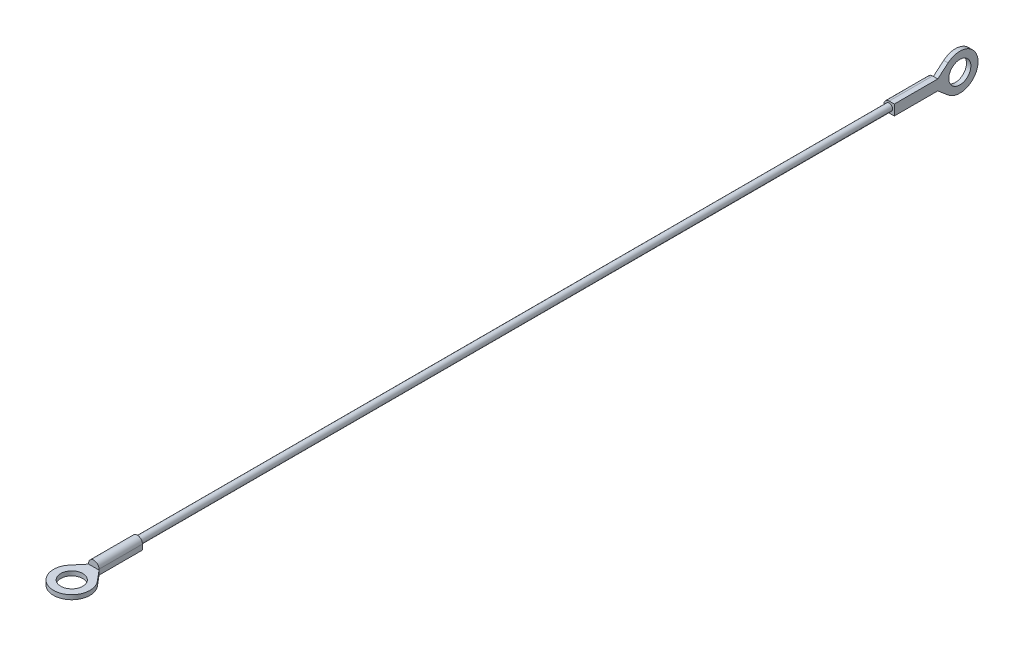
ISO-10303-21;
HEADER;
FILE_DESCRIPTION(('STEP AP214'),'2;1');
FILE_NAME('part.step','',(''),(''),'','','');
FILE_SCHEMA(('AUTOMOTIVE_DESIGN { 1 0 10303 214 1 1 1 1 }'));
ENDSEC;
DATA;
#1=APPLICATION_CONTEXT('core data for automotive mechanical design processes');
#2=APPLICATION_PROTOCOL_DEFINITION('international standard','automotive_design',2000,#1);
#3=PRODUCT_CONTEXT('',#1,'mechanical');
#4=PRODUCT('Part','Part','',(#3));
#5=PRODUCT_RELATED_PRODUCT_CATEGORY('part','',(#4));
#6=PRODUCT_DEFINITION_FORMATION('','',#4);
#7=PRODUCT_DEFINITION_CONTEXT('part definition',#1,'design');
#8=PRODUCT_DEFINITION('design','',#6,#7);
#9=PRODUCT_DEFINITION_SHAPE('','',#8);
#10=(LENGTH_UNIT() NAMED_UNIT(*) SI_UNIT(.MILLI.,.METRE.));
#11=(NAMED_UNIT(*) PLANE_ANGLE_UNIT() SI_UNIT($,.RADIAN.));
#12=(NAMED_UNIT(*) SI_UNIT($,.STERADIAN.) SOLID_ANGLE_UNIT());
#13=UNCERTAINTY_MEASURE_WITH_UNIT(LENGTH_MEASURE(1.E-05),#10,'distance_accuracy_value','');
#14=(GEOMETRIC_REPRESENTATION_CONTEXT(3) GLOBAL_UNCERTAINTY_ASSIGNED_CONTEXT((#13)) GLOBAL_UNIT_ASSIGNED_CONTEXT((#10,
#11,#12)) REPRESENTATION_CONTEXT('',''));
#15=CARTESIAN_POINT('',(0.,0.,0.));
#16=DIRECTION('',(0.,0.,1.));
#17=DIRECTION('',(1.,0.,0.));
#18=AXIS2_PLACEMENT_3D('',#15,#16,#17);
#19=CARTESIAN_POINT('',(0.,0.,-96.52));
#20=DIRECTION('',(0.,0.,-1.));
#21=DIRECTION('',(-1.,0.,0.));
#22=AXIS2_PLACEMENT_3D('',#19,#20,#21);
#23=PLANE('',#22);
#24=DIRECTION('',(1.,0.,0.));
#25=VECTOR('',#24,1.);
#26=CARTESIAN_POINT('',(0.,1.195,-96.52));
#27=LINE('',#26,#25);
#28=CARTESIAN_POINT('',(0.,1.195,-96.52));
#29=VERTEX_POINT('',#28);
#30=CARTESIAN_POINT('',(0.185,1.195,-96.52));
#31=VERTEX_POINT('',#30);
#32=EDGE_CURVE('E179',#29,#31,#27,.T.);
#33=ORIENTED_EDGE('',*,*,#32,.T.);
#34=DIRECTION('',(0.,-1.,0.));
#35=VECTOR('',#34,1.);
#36=CARTESIAN_POINT('',(0.185,-1.195,-96.52));
#37=LINE('',#36,#35);
#38=CARTESIAN_POINT('',(0.185,-1.195,-96.52));
#39=VERTEX_POINT('',#38);
#40=EDGE_CURVE('E148',#31,#39,#37,.T.);
#41=ORIENTED_EDGE('',*,*,#40,.T.);
#42=DIRECTION('',(-1.,0.,0.));
#43=VECTOR('',#42,1.);
#44=CARTESIAN_POINT('',(1.195,-1.195,-96.52));
#45=LINE('',#44,#43);
#46=CARTESIAN_POINT('',(0.,-1.195,-96.52));
#47=VERTEX_POINT('',#46);
#48=EDGE_CURVE('E183',#39,#47,#45,.T.);
#49=ORIENTED_EDGE('',*,*,#48,.T.);
#50=CARTESIAN_POINT('',(0.,0.,-96.52));
#51=DIRECTION('',(0.,0.,-1.));
#52=DIRECTION('',(-1.,0.,0.));
#53=AXIS2_PLACEMENT_3D('',#50,#51,#52);
#54=CIRCLE('',#53,1.195);
#55=EDGE_CURVE('E176',#47,#29,#54,.T.);
#56=ORIENTED_EDGE('',*,*,#55,.T.);
#57=EDGE_LOOP('',(#33,#41,#49,#56));
#58=FACE_BOUND('',#57,.T.);
#59=ADVANCED_FACE('F35',(#58),#23,.T.);
#60=CARTESIAN_POINT('',(0.,0.,96.52));
#61=DIRECTION('',(0.,0.,1.));
#62=DIRECTION('',(1.,0.,0.));
#63=AXIS2_PLACEMENT_3D('',#60,#61,#62);
#64=PLANE('',#63);
#65=DIRECTION('',(0.,-1.,0.));
#66=VECTOR('',#65,1.);
#67=CARTESIAN_POINT('',(-1.195,0.,96.52));
#68=LINE('',#67,#66);
#69=CARTESIAN_POINT('',(-1.195,0.,96.52));
#70=VERTEX_POINT('',#69);
#71=CARTESIAN_POINT('',(-1.195,-0.185,96.52));
#72=VERTEX_POINT('',#71);
#73=EDGE_CURVE('E240',#70,#72,#68,.T.);
#74=ORIENTED_EDGE('',*,*,#73,.T.);
#75=DIRECTION('',(1.,0.,0.));
#76=VECTOR('',#75,1.);
#77=CARTESIAN_POINT('',(-1.195,-0.185,96.52));
#78=LINE('',#77,#76);
#79=CARTESIAN_POINT('',(1.195,-0.185,96.52));
#80=VERTEX_POINT('',#79);
#81=EDGE_CURVE('E212',#72,#80,#78,.T.);
#82=ORIENTED_EDGE('',*,*,#81,.T.);
#83=DIRECTION('',(0.,1.,0.));
#84=VECTOR('',#83,1.);
#85=CARTESIAN_POINT('',(1.195,-1.195,96.52));
#86=LINE('',#85,#84);
#87=CARTESIAN_POINT('',(1.195,0.,96.52));
#88=VERTEX_POINT('',#87);
#89=EDGE_CURVE('E244',#80,#88,#86,.T.);
#90=ORIENTED_EDGE('',*,*,#89,.T.);
#91=CARTESIAN_POINT('',(0.,0.,96.52));
#92=DIRECTION('',(0.,0.,1.));
#93=DIRECTION('',(1.,0.,0.));
#94=AXIS2_PLACEMENT_3D('',#91,#92,#93);
#95=CIRCLE('',#94,1.195);
#96=EDGE_CURVE('E237',#88,#70,#95,.T.);
#97=ORIENTED_EDGE('',*,*,#96,.T.);
#98=EDGE_LOOP('',(#74,#82,#90,#97));
#99=FACE_BOUND('',#98,.T.);
#100=ADVANCED_FACE('F289',(#99),#64,.T.);
#101=CARTESIAN_POINT('',(0.,0.,86.52));
#102=DIRECTION('',(0.,0.,-1.));
#103=DIRECTION('',(-1.,0.,0.));
#104=AXIS2_PLACEMENT_3D('',#101,#102,#103);
#105=CYLINDRICAL_SURFACE('',#104,0.795);
#106=CARTESIAN_POINT('',(0.,0.,86.52));
#107=DIRECTION('',(0.,0.,1.));
#108=DIRECTION('',(1.,0.,0.));
#109=AXIS2_PLACEMENT_3D('',#106,#107,#108);
#110=CIRCLE('',#109,0.795);
#111=CARTESIAN_POINT('',(0.795,0.,86.52));
#112=VERTEX_POINT('',#111);
#113=EDGE_CURVE('E11',#112,#112,#110,.T.);
#114=ORIENTED_EDGE('',*,*,#113,.F.);
#115=EDGE_LOOP('',(#114));
#116=FACE_BOUND('',#115,.T.);
#117=CARTESIAN_POINT('',(0.,0.,-86.52));
#118=DIRECTION('',(0.,0.,1.));
#119=DIRECTION('',(1.,0.,0.));
#120=AXIS2_PLACEMENT_3D('',#117,#118,#119);
#121=CIRCLE('',#120,0.795);
#122=CARTESIAN_POINT('',(0.795,0.,-86.52));
#123=VERTEX_POINT('',#122);
#124=EDGE_CURVE('E39',#123,#123,#121,.T.);
#125=ORIENTED_EDGE('',*,*,#124,.T.);
#126=EDGE_LOOP('',(#125));
#127=FACE_BOUND('',#126,.T.);
#128=ADVANCED_FACE('F37',(#116,#127),#105,.T.);
#129=CARTESIAN_POINT('',(0.,0.,96.52));
#130=DIRECTION('',(0.,0.,-1.));
#131=DIRECTION('',(-1.,0.,0.));
#132=AXIS2_PLACEMENT_3D('',#129,#130,#131);
#133=CYLINDRICAL_SURFACE('',#132,1.195);
#134=CARTESIAN_POINT('',(0.,0.,86.52));
#135=DIRECTION('',(0.,0.,1.));
#136=DIRECTION('',(1.,0.,0.));
#137=AXIS2_PLACEMENT_3D('',#134,#135,#136);
#138=CIRCLE('',#137,1.195);
#139=CARTESIAN_POINT('',(1.195,0.,86.52));
#140=VERTEX_POINT('',#139);
#141=CARTESIAN_POINT('',(-1.195,0.,86.52));
#142=VERTEX_POINT('',#141);
#143=EDGE_CURVE('E233',#140,#142,#138,.T.);
#144=ORIENTED_EDGE('',*,*,#143,.T.);
#145=DIRECTION('',(0.,0.,-1.));
#146=VECTOR('',#145,1.);
#147=CARTESIAN_POINT('',(-1.195,0.,96.52));
#148=LINE('',#147,#146);
#149=EDGE_CURVE('E44',#70,#142,#148,.T.);
#150=ORIENTED_EDGE('',*,*,#149,.F.);
#151=ORIENTED_EDGE('',*,*,#96,.F.);
#152=DIRECTION('',(0.,0.,-1.));
#153=VECTOR('',#152,1.);
#154=CARTESIAN_POINT('',(1.195,0.,96.52));
#155=LINE('',#154,#153);
#156=EDGE_CURVE('E247',#88,#140,#155,.T.);
#157=ORIENTED_EDGE('',*,*,#156,.T.);
#158=EDGE_LOOP('',(#144,#150,#151,#157));
#159=FACE_BOUND('',#158,.T.);
#160=ADVANCED_FACE('F273',(#159),#133,.T.);
#161=CARTESIAN_POINT('',(-1.195,0.,96.52));
#162=DIRECTION('',(1.,0.,0.));
#163=DIRECTION('',(0.,1.,0.));
#164=AXIS2_PLACEMENT_3D('',#161,#162,#163);
#165=PLANE('',#164);
#166=DIRECTION('',(0.,-1.,0.));
#167=VECTOR('',#166,1.);
#168=CARTESIAN_POINT('',(-1.195,0.,86.52));
#169=LINE('',#168,#167);
#170=CARTESIAN_POINT('',(-1.195,-1.195,86.52));
#171=VERTEX_POINT('',#170);
#172=EDGE_CURVE('E250',#142,#171,#169,.T.);
#173=ORIENTED_EDGE('',*,*,#172,.T.);
#174=DIRECTION('',(0.,0.,-1.));
#175=VECTOR('',#174,1.);
#176=CARTESIAN_POINT('',(-1.195,-1.195,96.52));
#177=LINE('',#176,#175);
#178=CARTESIAN_POINT('',(-1.195,-1.195,96.52));
#179=VERTEX_POINT('',#178);
#180=EDGE_CURVE('E261',#179,#171,#177,.T.);
#181=ORIENTED_EDGE('',*,*,#180,.F.);
#182=DIRECTION('',(0.,-1.,0.));
#183=VECTOR('',#182,1.);
#184=CARTESIAN_POINT('',(-1.195,-0.185,96.52));
#185=LINE('',#184,#183);
#186=EDGE_CURVE('E231',#72,#179,#185,.T.);
#187=ORIENTED_EDGE('',*,*,#186,.F.);
#188=ORIENTED_EDGE('',*,*,#73,.F.);
#189=ORIENTED_EDGE('',*,*,#149,.T.);
#190=EDGE_LOOP('',(#173,#181,#187,#188,#189));
#191=FACE_BOUND('',#190,.T.);
#192=ADVANCED_FACE('F267',(#191),#165,.F.);
#193=CARTESIAN_POINT('',(0.,-1.195,96.52));
#194=DIRECTION('',(0.,1.,0.));
#195=DIRECTION('',(0.,0.,1.));
#196=AXIS2_PLACEMENT_3D('',#193,#194,#195);
#197=PLANE('',#196);
#198=DIRECTION('',(1.,0.,0.));
#199=VECTOR('',#198,1.);
#200=CARTESIAN_POINT('',(0.,-1.195,86.52));
#201=LINE('',#200,#199);
#202=CARTESIAN_POINT('',(1.195,-1.195,86.52));
#203=VERTEX_POINT('',#202);
#204=EDGE_CURVE('E253',#171,#203,#201,.T.);
#205=ORIENTED_EDGE('',*,*,#204,.T.);
#206=DIRECTION('',(0.,0.,-1.));
#207=VECTOR('',#206,1.);
#208=CARTESIAN_POINT('',(1.195,-1.195,96.52));
#209=LINE('',#208,#207);
#210=CARTESIAN_POINT('',(1.195,-1.195,96.52));
#211=VERTEX_POINT('',#210);
#212=EDGE_CURVE('E258',#211,#203,#209,.T.);
#213=ORIENTED_EDGE('',*,*,#212,.F.);
#214=DIRECTION('',(0.645049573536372,0.,0.764140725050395));
#215=VECTOR('',#214,1.);
#216=CARTESIAN_POINT('',(1.195,-1.195,96.52));
#217=LINE('',#216,#215);
#218=CARTESIAN_POINT('',(3.20174963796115,-1.195,98.8972422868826));
#219=VERTEX_POINT('',#218);
#220=EDGE_CURVE('E208',#211,#219,#217,.T.);
#221=ORIENTED_EDGE('',*,*,#220,.T.);
#222=CARTESIAN_POINT('',(0.,-1.195,101.6));
#223=DIRECTION('',(0.,-1.,0.));
#224=DIRECTION('',(0.,0.,-1.));
#225=AXIS2_PLACEMENT_3D('',#222,#223,#224);
#226=CIRCLE('',#225,4.19);
#227=CARTESIAN_POINT('',(-3.20174963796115,-1.195,98.8972422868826));
#228=VERTEX_POINT('',#227);
#229=EDGE_CURVE('E226',#219,#228,#226,.T.);
#230=ORIENTED_EDGE('',*,*,#229,.T.);
#231=DIRECTION('',(0.645049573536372,0.,-0.764140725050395));
#232=VECTOR('',#231,1.);
#233=CARTESIAN_POINT('',(-3.20174963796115,-1.195,98.8972422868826));
#234=LINE('',#233,#232);
#235=EDGE_CURVE('E215',#228,#179,#234,.T.);
#236=ORIENTED_EDGE('',*,*,#235,.T.);
#237=ORIENTED_EDGE('',*,*,#180,.T.);
#238=EDGE_LOOP('',(#205,#213,#221,#230,#236,#237));
#239=FACE_BOUND('',#238,.T.);
#240=CARTESIAN_POINT('',(0.,-1.195,101.6));
#241=DIRECTION('',(0.,-1.,0.));
#242=DIRECTION('',(0.,0.,-1.));
#243=AXIS2_PLACEMENT_3D('',#240,#241,#242);
#244=CIRCLE('',#243,2.53999999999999);
#245=CARTESIAN_POINT('',(0.,-1.195,99.06));
#246=VERTEX_POINT('',#245);
#247=EDGE_CURVE('E209',#246,#246,#244,.T.);
#248=ORIENTED_EDGE('',*,*,#247,.F.);
#249=EDGE_LOOP('',(#248));
#250=FACE_BOUND('',#249,.T.);
#251=ADVANCED_FACE('F280',(#239,#250),#197,.F.);
#252=CARTESIAN_POINT('',(1.195,-1.195,96.52));
#253=DIRECTION('',(-1.,0.,0.));
#254=DIRECTION('',(0.,-1.,0.));
#255=AXIS2_PLACEMENT_3D('',#252,#253,#254);
#256=PLANE('',#255);
#257=DIRECTION('',(0.,1.,0.));
#258=VECTOR('',#257,1.);
#259=CARTESIAN_POINT('',(1.195,-1.195,86.52));
#260=LINE('',#259,#258);
#261=EDGE_CURVE('E241',#203,#140,#260,.T.);
#262=ORIENTED_EDGE('',*,*,#261,.T.);
#263=ORIENTED_EDGE('',*,*,#156,.F.);
#264=ORIENTED_EDGE('',*,*,#89,.F.);
#265=EDGE_CURVE('E245',#211,#80,#86,.T.);
#266=ORIENTED_EDGE('',*,*,#265,.F.);
#267=ORIENTED_EDGE('',*,*,#212,.T.);
#268=EDGE_LOOP('',(#262,#263,#264,#266,#267));
#269=FACE_BOUND('',#268,.T.);
#270=ADVANCED_FACE('F284',(#269),#256,.F.);
#271=CARTESIAN_POINT('',(0.,0.,86.52));
#272=DIRECTION('',(0.,0.,1.));
#273=DIRECTION('',(1.,0.,0.));
#274=AXIS2_PLACEMENT_3D('',#271,#272,#273);
#275=PLANE('',#274);
#276=ORIENTED_EDGE('',*,*,#113,.T.);
#277=EDGE_LOOP('',(#276));
#278=FACE_BOUND('',#277,.T.);
#279=ORIENTED_EDGE('',*,*,#143,.F.);
#280=ORIENTED_EDGE('',*,*,#261,.F.);
#281=ORIENTED_EDGE('',*,*,#204,.F.);
#282=ORIENTED_EDGE('',*,*,#172,.F.);
#283=EDGE_LOOP('',(#279,#280,#281,#282));
#284=FACE_BOUND('',#283,.T.);
#285=ADVANCED_FACE('F277',(#278,#284),#275,.F.);
#286=CARTESIAN_POINT('',(-3.20174963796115,-0.185,98.8972422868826));
#287=DIRECTION('',(-0.764140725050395,0.,-0.645049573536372));
#288=DIRECTION('',(-0.645049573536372,0.,0.764140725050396));
#289=AXIS2_PLACEMENT_3D('',#286,#287,#288);
#290=PLANE('',#289);
#291=ORIENTED_EDGE('',*,*,#235,.F.);
#292=DIRECTION('',(0.,-1.,0.));
#293=VECTOR('',#292,1.);
#294=CARTESIAN_POINT('',(-3.20174963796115,-0.185,98.8972422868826));
#295=LINE('',#294,#293);
#296=CARTESIAN_POINT('',(-3.20174963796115,-0.185,98.8972422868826));
#297=VERTEX_POINT('',#296);
#298=EDGE_CURVE('E234',#297,#228,#295,.T.);
#299=ORIENTED_EDGE('',*,*,#298,.F.);
#300=DIRECTION('',(0.645049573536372,0.,-0.764140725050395));
#301=VECTOR('',#300,1.);
#302=CARTESIAN_POINT('',(-3.20174963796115,-0.185,98.8972422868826));
#303=LINE('',#302,#301);
#304=EDGE_CURVE('E220',#297,#72,#303,.T.);
#305=ORIENTED_EDGE('',*,*,#304,.T.);
#306=ORIENTED_EDGE('',*,*,#186,.T.);
#307=EDGE_LOOP('',(#291,#299,#305,#306));
#308=FACE_BOUND('',#307,.T.);
#309=ADVANCED_FACE('F294',(#308),#290,.T.);
#310=CARTESIAN_POINT('',(0.,-0.185,101.6));
#311=DIRECTION('',(0.,-1.,0.));
#312=DIRECTION('',(0.,0.,-1.));
#313=AXIS2_PLACEMENT_3D('',#310,#311,#312);
#314=CYLINDRICAL_SURFACE('',#313,4.19);
#315=ORIENTED_EDGE('',*,*,#229,.F.);
#316=DIRECTION('',(0.,-1.,0.));
#317=VECTOR('',#316,1.);
#318=CARTESIAN_POINT('',(3.20174963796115,-0.185,98.8972422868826));
#319=LINE('',#318,#317);
#320=CARTESIAN_POINT('',(3.20174963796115,-0.185,98.8972422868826));
#321=VERTEX_POINT('',#320);
#322=EDGE_CURVE('E223',#321,#219,#319,.T.);
#323=ORIENTED_EDGE('',*,*,#322,.F.);
#324=CARTESIAN_POINT('',(0.,-0.185,101.6));
#325=DIRECTION('',(0.,-1.,0.));
#326=DIRECTION('',(0.,0.,-1.));
#327=AXIS2_PLACEMENT_3D('',#324,#325,#326);
#328=CIRCLE('',#327,4.19);
#329=EDGE_CURVE('E217',#321,#297,#328,.T.);
#330=ORIENTED_EDGE('',*,*,#329,.T.);
#331=ORIENTED_EDGE('',*,*,#298,.T.);
#332=EDGE_LOOP('',(#315,#323,#330,#331));
#333=FACE_BOUND('',#332,.T.);
#334=ADVANCED_FACE('F297',(#333),#314,.T.);
#335=CARTESIAN_POINT('',(1.195,-0.185,96.52));
#336=DIRECTION('',(0.764140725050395,0.,-0.645049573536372));
#337=DIRECTION('',(-0.645049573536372,0.,-0.764140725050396));
#338=AXIS2_PLACEMENT_3D('',#335,#336,#337);
#339=PLANE('',#338);
#340=ORIENTED_EDGE('',*,*,#220,.F.);
#341=ORIENTED_EDGE('',*,*,#265,.T.);
#342=DIRECTION('',(0.645049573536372,0.,0.764140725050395));
#343=VECTOR('',#342,1.);
#344=CARTESIAN_POINT('',(1.195,-0.185,96.52));
#345=LINE('',#344,#343);
#346=EDGE_CURVE('E59',#80,#321,#345,.T.);
#347=ORIENTED_EDGE('',*,*,#346,.T.);
#348=ORIENTED_EDGE('',*,*,#322,.T.);
#349=EDGE_LOOP('',(#340,#341,#347,#348));
#350=FACE_BOUND('',#349,.T.);
#351=ADVANCED_FACE('F287',(#350),#339,.T.);
#352=CARTESIAN_POINT('',(0.,-0.185,101.6));
#353=DIRECTION('',(0.,-1.,0.));
#354=DIRECTION('',(0.,0.,-1.));
#355=AXIS2_PLACEMENT_3D('',#352,#353,#354);
#356=PLANE('',#355);
#357=CARTESIAN_POINT('',(0.,-0.185,101.6));
#358=DIRECTION('',(0.,-1.,0.));
#359=DIRECTION('',(0.,0.,-1.));
#360=AXIS2_PLACEMENT_3D('',#357,#358,#359);
#361=CIRCLE('',#360,2.53999999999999);
#362=CARTESIAN_POINT('',(0.,-0.185,99.06));
#363=VERTEX_POINT('',#362);
#364=EDGE_CURVE('E205',#363,#363,#361,.T.);
#365=ORIENTED_EDGE('',*,*,#364,.T.);
#366=EDGE_LOOP('',(#365));
#367=FACE_BOUND('',#366,.T.);
#368=ORIENTED_EDGE('',*,*,#81,.F.);
#369=ORIENTED_EDGE('',*,*,#304,.F.);
#370=ORIENTED_EDGE('',*,*,#329,.F.);
#371=ORIENTED_EDGE('',*,*,#346,.F.);
#372=EDGE_LOOP('',(#368,#369,#370,#371));
#373=FACE_BOUND('',#372,.T.);
#374=ADVANCED_FACE('F291',(#367,#373),#356,.F.);
#375=CARTESIAN_POINT('',(0.,-0.185,101.6));
#376=DIRECTION('',(0.,-1.,0.));
#377=DIRECTION('',(0.,0.,-1.));
#378=AXIS2_PLACEMENT_3D('',#375,#376,#377);
#379=CYLINDRICAL_SURFACE('',#378,2.53999999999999);
#380=ORIENTED_EDGE('',*,*,#364,.F.);
#381=EDGE_LOOP('',(#380));
#382=FACE_BOUND('',#381,.T.);
#383=ORIENTED_EDGE('',*,*,#247,.T.);
#384=EDGE_LOOP('',(#383));
#385=FACE_BOUND('',#384,.T.);
#386=ADVANCED_FACE('F335',(#382,#385),#379,.F.);
#387=CARTESIAN_POINT('',(0.,0.,-96.52));
#388=DIRECTION('',(0.,0.,1.));
#389=DIRECTION('',(1.,0.,0.));
#390=AXIS2_PLACEMENT_3D('',#387,#388,#389);
#391=CYLINDRICAL_SURFACE('',#390,1.195);
#392=CARTESIAN_POINT('',(0.,0.,-86.52));
#393=DIRECTION('',(0.,0.,-1.));
#394=DIRECTION('',(-1.,0.,0.));
#395=AXIS2_PLACEMENT_3D('',#392,#393,#394);
#396=CIRCLE('',#395,1.195);
#397=CARTESIAN_POINT('',(0.,-1.195,-86.52));
#398=VERTEX_POINT('',#397);
#399=CARTESIAN_POINT('',(0.,1.195,-86.52));
#400=VERTEX_POINT('',#399);
#401=EDGE_CURVE('E174',#398,#400,#396,.T.);
#402=ORIENTED_EDGE('',*,*,#401,.T.);
#403=DIRECTION('',(0.,0.,1.));
#404=VECTOR('',#403,1.);
#405=CARTESIAN_POINT('',(0.,1.195,-96.52));
#406=LINE('',#405,#404);
#407=EDGE_CURVE('E202',#29,#400,#406,.T.);
#408=ORIENTED_EDGE('',*,*,#407,.F.);
#409=ORIENTED_EDGE('',*,*,#55,.F.);
#410=DIRECTION('',(0.,0.,1.));
#411=VECTOR('',#410,1.);
#412=CARTESIAN_POINT('',(0.,-1.195,-96.52));
#413=LINE('',#412,#411);
#414=EDGE_CURVE('E185',#47,#398,#413,.T.);
#415=ORIENTED_EDGE('',*,*,#414,.T.);
#416=EDGE_LOOP('',(#402,#408,#409,#415));
#417=FACE_BOUND('',#416,.T.);
#418=ADVANCED_FACE('F331',(#417),#391,.T.);
#419=CARTESIAN_POINT('',(0.,1.195,-96.52));
#420=DIRECTION('',(0.,-1.,0.));
#421=DIRECTION('',(0.,0.,-1.));
#422=AXIS2_PLACEMENT_3D('',#419,#420,#421);
#423=PLANE('',#422);
#424=DIRECTION('',(1.,0.,0.));
#425=VECTOR('',#424,1.);
#426=CARTESIAN_POINT('',(0.,1.195,-86.52));
#427=LINE('',#426,#425);
#428=CARTESIAN_POINT('',(1.195,1.195,-86.52));
#429=VERTEX_POINT('',#428);
#430=EDGE_CURVE('E188',#400,#429,#427,.T.);
#431=ORIENTED_EDGE('',*,*,#430,.T.);
#432=DIRECTION('',(0.,0.,1.));
#433=VECTOR('',#432,1.);
#434=CARTESIAN_POINT('',(1.195,1.195,-96.52));
#435=LINE('',#434,#433);
#436=CARTESIAN_POINT('',(1.195,1.195,-96.52));
#437=VERTEX_POINT('',#436);
#438=EDGE_CURVE('E199',#437,#429,#435,.T.);
#439=ORIENTED_EDGE('',*,*,#438,.F.);
#440=DIRECTION('',(1.,0.,0.));
#441=VECTOR('',#440,1.);
#442=CARTESIAN_POINT('',(0.185,1.195,-96.52));
#443=LINE('',#442,#441);
#444=EDGE_CURVE('E172',#31,#437,#443,.T.);
#445=ORIENTED_EDGE('',*,*,#444,.F.);
#446=ORIENTED_EDGE('',*,*,#32,.F.);
#447=ORIENTED_EDGE('',*,*,#407,.T.);
#448=EDGE_LOOP('',(#431,#439,#445,#446,#447));
#449=FACE_BOUND('',#448,.T.);
#450=ADVANCED_FACE('F327',(#449),#423,.F.);
#451=CARTESIAN_POINT('',(1.195,0.,-96.52));
#452=DIRECTION('',(-1.,0.,0.));
#453=DIRECTION('',(0.,-1.,0.));
#454=AXIS2_PLACEMENT_3D('',#451,#452,#453);
#455=PLANE('',#454);
#456=DIRECTION('',(0.,-1.,0.));
#457=VECTOR('',#456,1.);
#458=CARTESIAN_POINT('',(1.195,0.,-86.52));
#459=LINE('',#458,#457);
#460=CARTESIAN_POINT('',(1.195,-1.195,-86.52));
#461=VERTEX_POINT('',#460);
#462=EDGE_CURVE('E191',#429,#461,#459,.T.);
#463=ORIENTED_EDGE('',*,*,#462,.T.);
#464=DIRECTION('',(0.,0.,1.));
#465=VECTOR('',#464,1.);
#466=CARTESIAN_POINT('',(1.195,-1.195,-96.52));
#467=LINE('',#466,#465);
#468=CARTESIAN_POINT('',(1.195,-1.195,-96.52));
#469=VERTEX_POINT('',#468);
#470=EDGE_CURVE('E196',#469,#461,#467,.T.);
#471=ORIENTED_EDGE('',*,*,#470,.F.);
#472=DIRECTION('',(0.,-0.645049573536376,-0.764140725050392));
#473=VECTOR('',#472,1.);
#474=CARTESIAN_POINT('',(1.195,-3.20174963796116,-98.8972422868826));
#475=LINE('',#474,#473);
#476=CARTESIAN_POINT('',(1.195,-3.20174963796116,-98.8972422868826));
#477=VERTEX_POINT('',#476);
#478=EDGE_CURVE('E168',#469,#477,#475,.T.);
#479=ORIENTED_EDGE('',*,*,#478,.T.);
#480=CARTESIAN_POINT('',(1.195,0.,-101.6));
#481=DIRECTION('',(1.,0.,0.));
#482=DIRECTION('',(0.,0.,1.));
#483=AXIS2_PLACEMENT_3D('',#480,#481,#482);
#484=CIRCLE('',#483,4.19000000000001);
#485=CARTESIAN_POINT('',(1.195,3.20174963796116,-98.8972422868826));
#486=VERTEX_POINT('',#485);
#487=EDGE_CURVE('E144',#477,#486,#484,.T.);
#488=ORIENTED_EDGE('',*,*,#487,.T.);
#489=DIRECTION('',(0.,-0.645049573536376,0.764140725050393));
#490=VECTOR('',#489,1.);
#491=CARTESIAN_POINT('',(1.195,1.195,-96.52));
#492=LINE('',#491,#490);
#493=EDGE_CURVE('E158',#486,#437,#492,.T.);
#494=ORIENTED_EDGE('',*,*,#493,.T.);
#495=ORIENTED_EDGE('',*,*,#438,.T.);
#496=EDGE_LOOP('',(#463,#471,#479,#488,#494,#495));
#497=FACE_BOUND('',#496,.T.);
#498=CARTESIAN_POINT('',(1.195,0.,-101.6));
#499=DIRECTION('',(1.,0.,0.));
#500=DIRECTION('',(0.,0.,-1.));
#501=AXIS2_PLACEMENT_3D('',#498,#499,#500);
#502=CIRCLE('',#501,2.54);
#503=CARTESIAN_POINT('',(1.195,0.,-104.14));
#504=VERTEX_POINT('',#503);
#505=EDGE_CURVE('E163',#504,#504,#502,.T.);
#506=ORIENTED_EDGE('',*,*,#505,.F.);
#507=EDGE_LOOP('',(#506));
#508=FACE_BOUND('',#507,.T.);
#509=ADVANCED_FACE('F323',(#497,#508),#455,.F.);
#510=CARTESIAN_POINT('',(1.195,-1.195,-96.52));
#511=DIRECTION('',(0.,1.,0.));
#512=DIRECTION('',(0.,0.,1.));
#513=AXIS2_PLACEMENT_3D('',#510,#511,#512);
#514=PLANE('',#513);
#515=DIRECTION('',(-1.,0.,0.));
#516=VECTOR('',#515,1.);
#517=CARTESIAN_POINT('',(1.195,-1.195,-86.52));
#518=LINE('',#517,#516);
#519=EDGE_CURVE('E180',#461,#398,#518,.T.);
#520=ORIENTED_EDGE('',*,*,#519,.T.);
#521=ORIENTED_EDGE('',*,*,#414,.F.);
#522=ORIENTED_EDGE('',*,*,#48,.F.);
#523=EDGE_CURVE('E156',#469,#39,#45,.T.);
#524=ORIENTED_EDGE('',*,*,#523,.F.);
#525=ORIENTED_EDGE('',*,*,#470,.T.);
#526=EDGE_LOOP('',(#520,#521,#522,#524,#525));
#527=FACE_BOUND('',#526,.T.);
#528=ADVANCED_FACE('F319',(#527),#514,.F.);
#529=CARTESIAN_POINT('',(0.,0.,-86.52));
#530=DIRECTION('',(0.,0.,-1.));
#531=DIRECTION('',(-1.,0.,0.));
#532=AXIS2_PLACEMENT_3D('',#529,#530,#531);
#533=PLANE('',#532);
#534=ORIENTED_EDGE('',*,*,#124,.F.);
#535=EDGE_LOOP('',(#534));
#536=FACE_BOUND('',#535,.T.);
#537=ORIENTED_EDGE('',*,*,#401,.F.);
#538=ORIENTED_EDGE('',*,*,#519,.F.);
#539=ORIENTED_EDGE('',*,*,#462,.F.);
#540=ORIENTED_EDGE('',*,*,#430,.F.);
#541=EDGE_LOOP('',(#537,#538,#539,#540));
#542=FACE_BOUND('',#541,.T.);
#543=ADVANCED_FACE('F316',(#536,#542),#533,.F.);
#544=CARTESIAN_POINT('',(0.185,-3.20174963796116,-98.8972422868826));
#545=DIRECTION('',(0.,-0.764140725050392,0.645049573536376));
#546=DIRECTION('',(0.,-0.645049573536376,-0.764140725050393));
#547=AXIS2_PLACEMENT_3D('',#544,#545,#546);
#548=PLANE('',#547);
#549=ORIENTED_EDGE('',*,*,#478,.F.);
#550=ORIENTED_EDGE('',*,*,#523,.T.);
#551=DIRECTION('',(0.,-0.645049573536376,-0.764140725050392));
#552=VECTOR('',#551,1.);
#553=CARTESIAN_POINT('',(0.185,-3.20174963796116,-98.8972422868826));
#554=LINE('',#553,#552);
#555=CARTESIAN_POINT('',(0.185,-3.20174963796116,-98.8972422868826));
#556=VERTEX_POINT('',#555);
#557=EDGE_CURVE('E51',#39,#556,#554,.T.);
#558=ORIENTED_EDGE('',*,*,#557,.T.);
#559=DIRECTION('',(1.,0.,0.));
#560=VECTOR('',#559,1.);
#561=CARTESIAN_POINT('',(0.185,-3.20174963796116,-98.8972422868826));
#562=LINE('',#561,#560);
#563=EDGE_CURVE('E140',#556,#477,#562,.T.);
#564=ORIENTED_EDGE('',*,*,#563,.T.);
#565=EDGE_LOOP('',(#549,#550,#558,#564));
#566=FACE_BOUND('',#565,.T.);
#567=ADVANCED_FACE('F154',(#566),#548,.T.);
#568=CARTESIAN_POINT('',(0.185,1.195,-96.52));
#569=DIRECTION('',(0.,0.764140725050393,0.645049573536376));
#570=DIRECTION('',(0.,-0.645049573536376,0.764140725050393));
#571=AXIS2_PLACEMENT_3D('',#568,#569,#570);
#572=PLANE('',#571);
#573=ORIENTED_EDGE('',*,*,#493,.F.);
#574=DIRECTION('',(1.,0.,0.));
#575=VECTOR('',#574,1.);
#576=CARTESIAN_POINT('',(0.185,3.20174963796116,-98.8972422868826));
#577=LINE('',#576,#575);
#578=CARTESIAN_POINT('',(0.185,3.20174963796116,-98.8972422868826));
#579=VERTEX_POINT('',#578);
#580=EDGE_CURVE('E147',#579,#486,#577,.T.);
#581=ORIENTED_EDGE('',*,*,#580,.F.);
#582=DIRECTION('',(0.,-0.645049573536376,0.764140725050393));
#583=VECTOR('',#582,1.);
#584=CARTESIAN_POINT('',(0.185,1.195,-96.52));
#585=LINE('',#584,#583);
#586=EDGE_CURVE('E152',#579,#31,#585,.T.);
#587=ORIENTED_EDGE('',*,*,#586,.T.);
#588=ORIENTED_EDGE('',*,*,#444,.T.);
#589=EDGE_LOOP('',(#573,#581,#587,#588));
#590=FACE_BOUND('',#589,.T.);
#591=ADVANCED_FACE('F380',(#590),#572,.T.);
#592=CARTESIAN_POINT('',(0.185,0.,-101.6));
#593=DIRECTION('',(1.,0.,0.));
#594=DIRECTION('',(0.,0.,-1.));
#595=AXIS2_PLACEMENT_3D('',#592,#593,#594);
#596=CYLINDRICAL_SURFACE('',#595,4.19000000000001);
#597=ORIENTED_EDGE('',*,*,#487,.F.);
#598=ORIENTED_EDGE('',*,*,#563,.F.);
#599=CARTESIAN_POINT('',(0.185,0.,-101.6));
#600=DIRECTION('',(1.,0.,0.));
#601=DIRECTION('',(0.,0.,1.));
#602=AXIS2_PLACEMENT_3D('',#599,#600,#601);
#603=CIRCLE('',#602,4.19000000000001);
#604=EDGE_CURVE('E142',#556,#579,#603,.T.);
#605=ORIENTED_EDGE('',*,*,#604,.T.);
#606=ORIENTED_EDGE('',*,*,#580,.T.);
#607=EDGE_LOOP('',(#597,#598,#605,#606));
#608=FACE_BOUND('',#607,.T.);
#609=ADVANCED_FACE('F141',(#608),#596,.T.);
#610=CARTESIAN_POINT('',(0.185,0.,-101.6));
#611=DIRECTION('',(-1.,0.,0.));
#612=DIRECTION('',(0.,0.,1.));
#613=AXIS2_PLACEMENT_3D('',#610,#611,#612);
#614=PLANE('',#613);
#615=CARTESIAN_POINT('',(0.185,0.,-101.6));
#616=DIRECTION('',(1.,0.,0.));
#617=DIRECTION('',(0.,0.,-1.));
#618=AXIS2_PLACEMENT_3D('',#615,#616,#617);
#619=CIRCLE('',#618,2.54);
#620=CARTESIAN_POINT('',(0.185,0.,-104.14));
#621=VERTEX_POINT('',#620);
#622=EDGE_CURVE('E170',#621,#621,#619,.T.);
#623=ORIENTED_EDGE('',*,*,#622,.T.);
#624=EDGE_LOOP('',(#623));
#625=FACE_BOUND('',#624,.T.);
#626=ORIENTED_EDGE('',*,*,#557,.F.);
#627=ORIENTED_EDGE('',*,*,#40,.F.);
#628=ORIENTED_EDGE('',*,*,#586,.F.);
#629=ORIENTED_EDGE('',*,*,#604,.F.);
#630=EDGE_LOOP('',(#626,#627,#628,#629));
#631=FACE_BOUND('',#630,.T.);
#632=ADVANCED_FACE('F151',(#625,#631),#614,.T.);
#633=CARTESIAN_POINT('',(0.185,0.,-101.6));
#634=DIRECTION('',(1.,0.,0.));
#635=DIRECTION('',(0.,0.,-1.));
#636=AXIS2_PLACEMENT_3D('',#633,#634,#635);
#637=CYLINDRICAL_SURFACE('',#636,2.54);
#638=ORIENTED_EDGE('',*,*,#622,.F.);
#639=EDGE_LOOP('',(#638));
#640=FACE_BOUND('',#639,.T.);
#641=ORIENTED_EDGE('',*,*,#505,.T.);
#642=EDGE_LOOP('',(#641));
#643=FACE_BOUND('',#642,.T.);
#644=ADVANCED_FACE('F390',(#640,#643),#637,.F.);
#645=CLOSED_SHELL('',(#59,#100,#128,#160,#192,#251,#270,#285,#309,#334,#351,#374,#386,#418,#450,
#509,#528,#543,#567,#591,#609,#632,#644));
#646=MANIFOLD_SOLID_BREP('B2',#645);
#647=ADVANCED_BREP_SHAPE_REPRESENTATION('',(#18,#646),#14);
#648=SHAPE_DEFINITION_REPRESENTATION(#9,#647);
ENDSEC;
END-ISO-10303-21;
